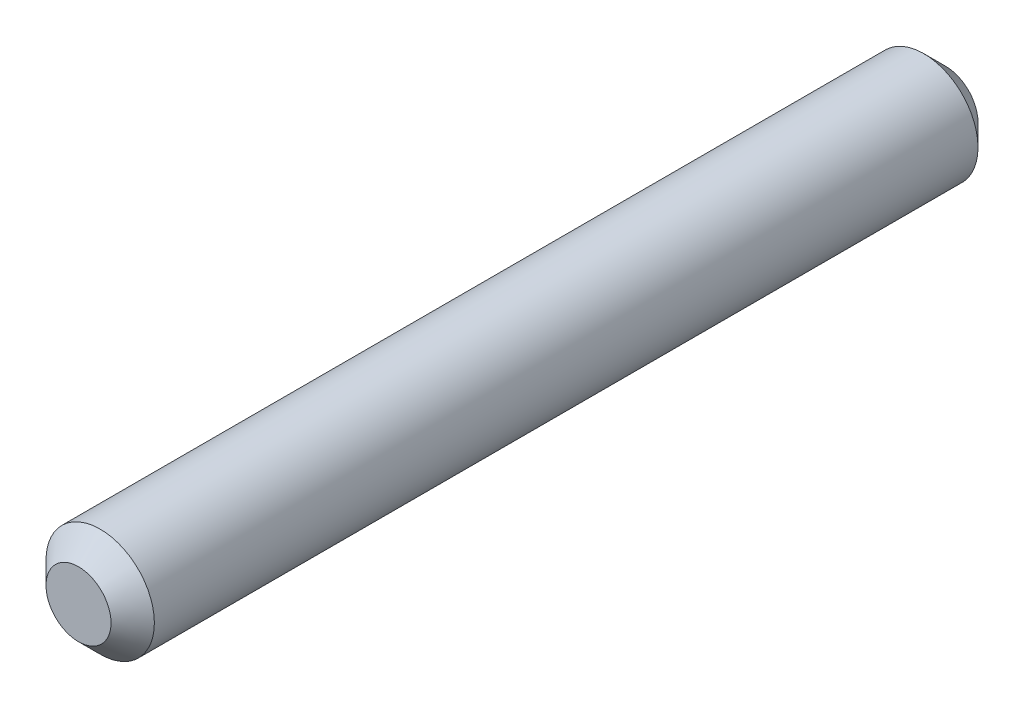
from build123d import *

# Parameters (mm, degrees)
SKETCH1_R           = 1.5875
BOSS_EXTRUDE1_DEPTH = 25.4
CHAMFER1_SIZE       = 0.635


with BuildPart() as part:
    # Sketch1 → Boss-Extrude1 (new body)
    with BuildSketch(Plane.XY):
        Circle(SKETCH1_R)
    extrude(amount=BOSS_EXTRUDE1_DEPTH)

    # Chamfer1
    chamfer1_edges = [part.edges().sort_by_distance(p)[0] for p in [
        (-1.5875, 0, 0),
        (-1.5875, 0, 25.4),
    ]]
    chamfer(chamfer1_edges, length=CHAMFER1_SIZE)


solid = part.part
